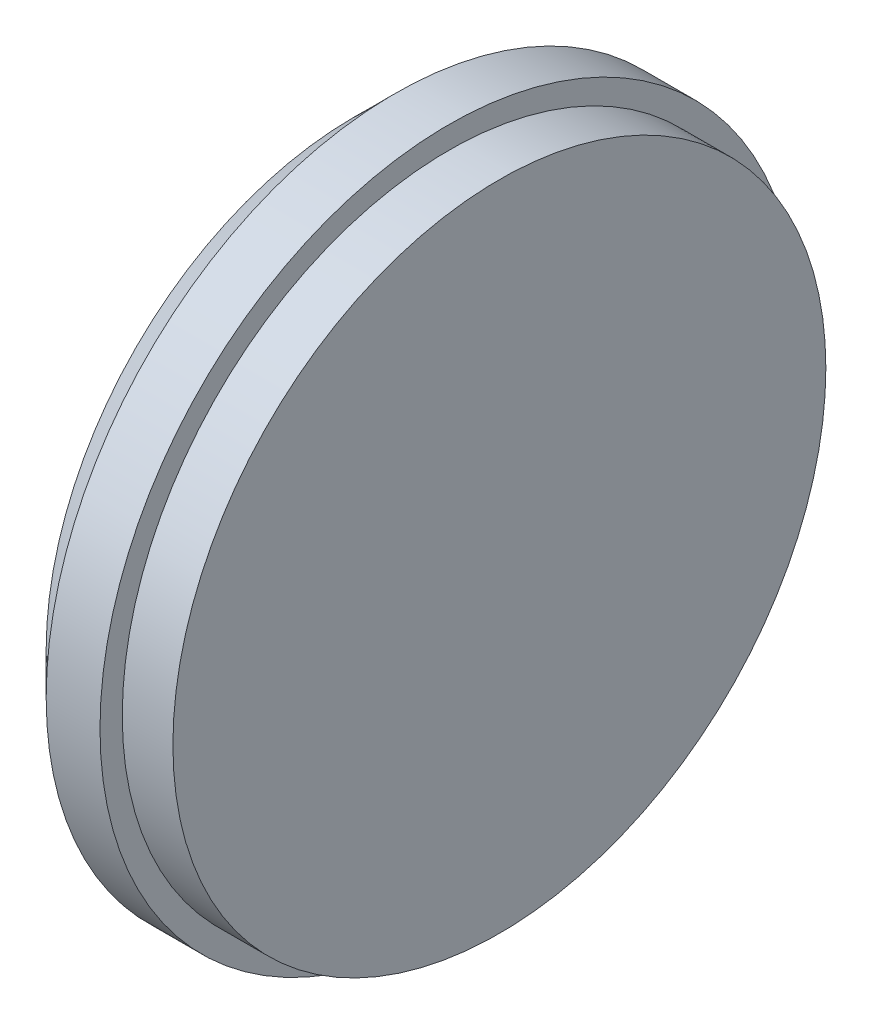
ISO-10303-21;
HEADER;
FILE_DESCRIPTION(('STEP AP214'),'2;1');
FILE_NAME('part.step','',(''),(''),'','','');
FILE_SCHEMA(('AUTOMOTIVE_DESIGN { 1 0 10303 214 1 1 1 1 }'));
ENDSEC;
DATA;
#1=APPLICATION_CONTEXT('core data for automotive mechanical design processes');
#2=APPLICATION_PROTOCOL_DEFINITION('international standard','automotive_design',2000,#1);
#3=PRODUCT_CONTEXT('',#1,'mechanical');
#4=PRODUCT('Part','Part','',(#3));
#5=PRODUCT_RELATED_PRODUCT_CATEGORY('part','',(#4));
#6=PRODUCT_DEFINITION_FORMATION('','',#4);
#7=PRODUCT_DEFINITION_CONTEXT('part definition',#1,'design');
#8=PRODUCT_DEFINITION('design','',#6,#7);
#9=PRODUCT_DEFINITION_SHAPE('','',#8);
#10=(LENGTH_UNIT() NAMED_UNIT(*) SI_UNIT(.MILLI.,.METRE.));
#11=(NAMED_UNIT(*) PLANE_ANGLE_UNIT() SI_UNIT($,.RADIAN.));
#12=(NAMED_UNIT(*) SI_UNIT($,.STERADIAN.) SOLID_ANGLE_UNIT());
#13=UNCERTAINTY_MEASURE_WITH_UNIT(LENGTH_MEASURE(1.E-05),#10,'distance_accuracy_value','');
#14=(GEOMETRIC_REPRESENTATION_CONTEXT(3) GLOBAL_UNCERTAINTY_ASSIGNED_CONTEXT((#13)) GLOBAL_UNIT_ASSIGNED_CONTEXT((#10,
#11,#12)) REPRESENTATION_CONTEXT('',''));
#15=CARTESIAN_POINT('',(0.,0.,0.));
#16=DIRECTION('',(0.,0.,1.));
#17=DIRECTION('',(1.,0.,0.));
#18=AXIS2_PLACEMENT_3D('',#15,#16,#17);
#19=CARTESIAN_POINT('',(-4.75996,38.1,0.));
#20=DIRECTION('',(1.,0.,0.));
#21=DIRECTION('',(0.,0.,-1.));
#22=AXIS2_PLACEMENT_3D('',#19,#20,#21);
#23=PLANE('',#22);
#24=CARTESIAN_POINT('',(-4.75996,38.1,0.));
#25=DIRECTION('',(-1.,0.,0.));
#26=DIRECTION('',(0.,0.,1.));
#27=AXIS2_PLACEMENT_3D('',#24,#25,#26);
#28=CIRCLE('',#27,40.9448);
#29=CARTESIAN_POINT('',(-4.75996,38.1,40.9448));
#30=VERTEX_POINT('',#29);
#31=EDGE_CURVE('E10',#30,#30,#28,.T.);
#32=ORIENTED_EDGE('',*,*,#31,.F.);
#33=EDGE_LOOP('',(#32));
#34=FACE_BOUND('',#33,.T.);
#35=ADVANCED_FACE('F31',(#34),#23,.T.);
#36=CARTESIAN_POINT('',(-23.01748,38.1,0.));
#37=DIRECTION('',(-1.,0.,0.));
#38=DIRECTION('',(0.,0.,1.));
#39=AXIS2_PLACEMENT_3D('',#36,#37,#38);
#40=CYLINDRICAL_SURFACE('',#39,40.9448);
#41=ORIENTED_EDGE('',*,*,#31,.T.);
#42=EDGE_LOOP('',(#41));
#43=FACE_BOUND('',#42,.T.);
#44=CARTESIAN_POINT('',(-11.10996,38.1,0.));
#45=DIRECTION('',(-1.,0.,0.));
#46=DIRECTION('',(0.,0.,1.));
#47=AXIS2_PLACEMENT_3D('',#44,#45,#46);
#48=CIRCLE('',#47,40.9448);
#49=CARTESIAN_POINT('',(-11.10996,38.1,40.9448));
#50=VERTEX_POINT('',#49);
#51=EDGE_CURVE('E37',#50,#50,#48,.T.);
#52=ORIENTED_EDGE('',*,*,#51,.F.);
#53=EDGE_LOOP('',(#52));
#54=FACE_BOUND('',#53,.T.);
#55=ADVANCED_FACE('F70',(#43,#54),#40,.T.);
#56=CARTESIAN_POINT('',(-11.10996,-2.8448,0.));
#57=DIRECTION('',(1.,0.,0.));
#58=DIRECTION('',(0.,0.,-1.));
#59=AXIS2_PLACEMENT_3D('',#56,#57,#58);
#60=PLANE('',#59);
#61=ORIENTED_EDGE('',*,*,#51,.T.);
#62=EDGE_LOOP('',(#61));
#63=FACE_BOUND('',#62,.T.);
#64=CARTESIAN_POINT('',(-11.10996,38.1,0.));
#65=DIRECTION('',(-1.,0.,0.));
#66=DIRECTION('',(0.,0.,1.));
#67=AXIS2_PLACEMENT_3D('',#64,#65,#66);
#68=CIRCLE('',#67,43.7388);
#69=CARTESIAN_POINT('',(-11.10996,38.1,43.7388));
#70=VERTEX_POINT('',#69);
#71=EDGE_CURVE('E41',#70,#70,#68,.T.);
#72=ORIENTED_EDGE('',*,*,#71,.F.);
#73=EDGE_LOOP('',(#72));
#74=FACE_BOUND('',#73,.T.);
#75=ADVANCED_FACE('F66',(#63,#74),#60,.T.);
#76=CARTESIAN_POINT('',(-23.01748,38.1,0.));
#77=DIRECTION('',(-1.,0.,0.));
#78=DIRECTION('',(0.,0.,1.));
#79=AXIS2_PLACEMENT_3D('',#76,#77,#78);
#80=CYLINDRICAL_SURFACE('',#79,43.7388);
#81=ORIENTED_EDGE('',*,*,#71,.T.);
#82=EDGE_LOOP('',(#81));
#83=FACE_BOUND('',#82,.T.);
#84=CARTESIAN_POINT('',(-17.85874,38.1,0.));
#85=DIRECTION('',(-1.,0.,0.));
#86=DIRECTION('',(0.,0.,1.));
#87=AXIS2_PLACEMENT_3D('',#84,#85,#86);
#88=CIRCLE('',#87,43.7388);
#89=CARTESIAN_POINT('',(-17.85874,38.1,43.7388));
#90=VERTEX_POINT('',#89);
#91=EDGE_CURVE('E45',#90,#90,#88,.T.);
#92=ORIENTED_EDGE('',*,*,#91,.F.);
#93=EDGE_LOOP('',(#92));
#94=FACE_BOUND('',#93,.T.);
#95=ADVANCED_FACE('F58',(#83,#94),#80,.T.);
#96=CARTESIAN_POINT('',(-23.01748,38.1,0.));
#97=DIRECTION('',(1.,0.,0.));
#98=DIRECTION('',(0.,0.,-1.));
#99=AXIS2_PLACEMENT_3D('',#96,#97,#98);
#100=CONICAL_SURFACE('',#99,38.5826,0.785151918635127);
#101=ORIENTED_EDGE('',*,*,#91,.T.);
#102=EDGE_LOOP('',(#101));
#103=FACE_BOUND('',#102,.T.);
#104=CARTESIAN_POINT('',(-23.01748,38.1,0.));
#105=DIRECTION('',(-1.,0.,0.));
#106=DIRECTION('',(0.,0.,1.));
#107=AXIS2_PLACEMENT_3D('',#104,#105,#106);
#108=CIRCLE('',#107,38.5826);
#109=CARTESIAN_POINT('',(-23.01748,38.1,38.5826));
#110=VERTEX_POINT('',#109);
#111=EDGE_CURVE('E50',#110,#110,#108,.T.);
#112=ORIENTED_EDGE('',*,*,#111,.F.);
#113=EDGE_LOOP('',(#112));
#114=FACE_BOUND('',#113,.T.);
#115=ADVANCED_FACE('F56',(#103,#114),#100,.T.);
#116=CARTESIAN_POINT('',(-23.01748,-0.482599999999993,0.));
#117=DIRECTION('',(-1.,0.,0.));
#118=DIRECTION('',(0.,0.,1.));
#119=AXIS2_PLACEMENT_3D('',#116,#117,#118);
#120=PLANE('',#119);
#121=ORIENTED_EDGE('',*,*,#111,.T.);
#122=EDGE_LOOP('',(#121));
#123=FACE_BOUND('',#122,.T.);
#124=ADVANCED_FACE('F54',(#123),#120,.T.);
#125=CLOSED_SHELL('',(#35,#55,#75,#95,#115,#124));
#126=MANIFOLD_SOLID_BREP('B2',#125);
#127=ADVANCED_BREP_SHAPE_REPRESENTATION('',(#18,#126),#14);
#128=SHAPE_DEFINITION_REPRESENTATION(#9,#127);
ENDSEC;
END-ISO-10303-21;
